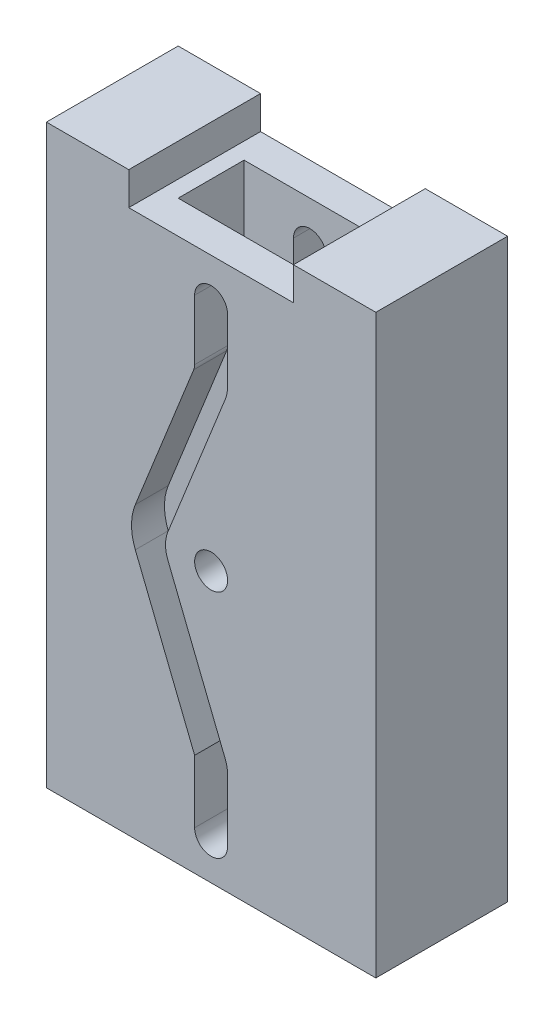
ISO-10303-21;
HEADER;
FILE_DESCRIPTION(('STEP AP214'),'2;1');
FILE_NAME('part.step','',(''),(''),'','','');
FILE_SCHEMA(('AUTOMOTIVE_DESIGN { 1 0 10303 214 1 1 1 1 }'));
ENDSEC;
DATA;
#1=APPLICATION_CONTEXT('core data for automotive mechanical design processes');
#2=APPLICATION_PROTOCOL_DEFINITION('international standard','automotive_design',2000,#1);
#3=PRODUCT_CONTEXT('',#1,'mechanical');
#4=PRODUCT('Part','Part','',(#3));
#5=PRODUCT_RELATED_PRODUCT_CATEGORY('part','',(#4));
#6=PRODUCT_DEFINITION_FORMATION('','',#4);
#7=PRODUCT_DEFINITION_CONTEXT('part definition',#1,'design');
#8=PRODUCT_DEFINITION('design','',#6,#7);
#9=PRODUCT_DEFINITION_SHAPE('','',#8);
#10=(LENGTH_UNIT() NAMED_UNIT(*) SI_UNIT(.MILLI.,.METRE.));
#11=(NAMED_UNIT(*) PLANE_ANGLE_UNIT() SI_UNIT($,.RADIAN.));
#12=(NAMED_UNIT(*) SI_UNIT($,.STERADIAN.) SOLID_ANGLE_UNIT());
#13=UNCERTAINTY_MEASURE_WITH_UNIT(LENGTH_MEASURE(1.E-05),#10,'distance_accuracy_value','');
#14=(GEOMETRIC_REPRESENTATION_CONTEXT(3) GLOBAL_UNCERTAINTY_ASSIGNED_CONTEXT((#13)) GLOBAL_UNIT_ASSIGNED_CONTEXT((#10,
#11,#12)) REPRESENTATION_CONTEXT('',''));
#15=CARTESIAN_POINT('',(0.,0.,0.));
#16=DIRECTION('',(0.,0.,1.));
#17=DIRECTION('',(1.,0.,0.));
#18=AXIS2_PLACEMENT_3D('',#15,#16,#17);
#19=CARTESIAN_POINT('',(50.,175.,40.));
#20=DIRECTION('',(0.,-1.,0.));
#21=DIRECTION('',(0.,0.,-1.));
#22=AXIS2_PLACEMENT_3D('',#19,#20,#21);
#23=PLANE('',#22);
#24=DIRECTION('',(-1.,0.,0.));
#25=VECTOR('',#24,1.);
#26=CARTESIAN_POINT('',(50.,175.,0.));
#27=LINE('',#26,#25);
#28=CARTESIAN_POINT('',(50.,175.,0.));
#29=VERTEX_POINT('',#28);
#30=CARTESIAN_POINT('',(25.,175.,0.));
#31=VERTEX_POINT('',#30);
#32=EDGE_CURVE('E611',#29,#31,#27,.T.);
#33=ORIENTED_EDGE('',*,*,#32,.T.);
#34=DIRECTION('',(0.,0.,-1.));
#35=VECTOR('',#34,1.);
#36=CARTESIAN_POINT('',(25.,175.,0.));
#37=LINE('',#36,#35);
#38=CARTESIAN_POINT('',(25.,175.,40.));
#39=VERTEX_POINT('',#38);
#40=EDGE_CURVE('E576',#39,#31,#37,.T.);
#41=ORIENTED_EDGE('',*,*,#40,.F.);
#42=DIRECTION('',(-1.,0.,0.));
#43=VECTOR('',#42,1.);
#44=CARTESIAN_POINT('',(50.,175.,40.));
#45=LINE('',#44,#43);
#46=CARTESIAN_POINT('',(50.,175.,40.));
#47=VERTEX_POINT('',#46);
#48=EDGE_CURVE('E622',#47,#39,#45,.T.);
#49=ORIENTED_EDGE('',*,*,#48,.F.);
#50=DIRECTION('',(0.,0.,-1.));
#51=VECTOR('',#50,1.);
#52=CARTESIAN_POINT('',(50.,175.,40.));
#53=LINE('',#52,#51);
#54=EDGE_CURVE('E633',#47,#29,#53,.T.);
#55=ORIENTED_EDGE('',*,*,#54,.T.);
#56=EDGE_LOOP('',(#33,#41,#49,#55));
#57=FACE_BOUND('',#56,.T.);
#58=ADVANCED_FACE('F24',(#57),#23,.F.);
#59=CARTESIAN_POINT('',(0.,0.,40.));
#60=DIRECTION('',(0.,1.,0.));
#61=DIRECTION('',(-1.,0.,0.));
#62=AXIS2_PLACEMENT_3D('',#59,#60,#61);
#63=PLANE('',#62);
#64=DIRECTION('',(1.,0.,0.));
#65=VECTOR('',#64,1.);
#66=CARTESIAN_POINT('',(20.,0.,30.));
#67=LINE('',#66,#65);
#68=CARTESIAN_POINT('',(-20.,0.,30.));
#69=VERTEX_POINT('',#68);
#70=CARTESIAN_POINT('',(20.,0.,30.));
#71=VERTEX_POINT('',#70);
#72=EDGE_CURVE('E532',#69,#71,#67,.T.);
#73=ORIENTED_EDGE('',*,*,#72,.T.);
#74=DIRECTION('',(0.,0.,-1.));
#75=VECTOR('',#74,1.);
#76=CARTESIAN_POINT('',(20.,0.,10.));
#77=LINE('',#76,#75);
#78=CARTESIAN_POINT('',(20.,0.,10.));
#79=VERTEX_POINT('',#78);
#80=EDGE_CURVE('E523',#71,#79,#77,.T.);
#81=ORIENTED_EDGE('',*,*,#80,.T.);
#82=DIRECTION('',(-1.,0.,0.));
#83=VECTOR('',#82,1.);
#84=CARTESIAN_POINT('',(20.,0.,10.));
#85=LINE('',#84,#83);
#86=CARTESIAN_POINT('',(-20.,0.,10.));
#87=VERTEX_POINT('',#86);
#88=EDGE_CURVE('E526',#79,#87,#85,.T.);
#89=ORIENTED_EDGE('',*,*,#88,.T.);
#90=DIRECTION('',(0.,0.,1.));
#91=VECTOR('',#90,1.);
#92=CARTESIAN_POINT('',(-20.,0.,10.));
#93=LINE('',#92,#91);
#94=EDGE_CURVE('E529',#87,#69,#93,.T.);
#95=ORIENTED_EDGE('',*,*,#94,.T.);
#96=EDGE_LOOP('',(#73,#81,#89,#95));
#97=FACE_BOUND('',#96,.T.);
#98=DIRECTION('',(1.,0.,0.));
#99=VECTOR('',#98,1.);
#100=CARTESIAN_POINT('',(0.,0.,0.));
#101=LINE('',#100,#99);
#102=CARTESIAN_POINT('',(-50.0000000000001,0.,0.));
#103=VERTEX_POINT('',#102);
#104=CARTESIAN_POINT('',(50.0000000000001,0.,0.));
#105=VERTEX_POINT('',#104);
#106=EDGE_CURVE('E599',#103,#105,#101,.T.);
#107=ORIENTED_EDGE('',*,*,#106,.T.);
#108=DIRECTION('',(0.,0.,-1.));
#109=VECTOR('',#108,1.);
#110=CARTESIAN_POINT('',(50.0000000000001,0.,40.));
#111=LINE('',#110,#109);
#112=CARTESIAN_POINT('',(50.0000000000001,0.,40.));
#113=VERTEX_POINT('',#112);
#114=EDGE_CURVE('E636',#113,#105,#111,.T.);
#115=ORIENTED_EDGE('',*,*,#114,.F.);
#116=DIRECTION('',(1.,0.,0.));
#117=VECTOR('',#116,1.);
#118=CARTESIAN_POINT('',(-50.0000000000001,0.,40.));
#119=LINE('',#118,#117);
#120=CARTESIAN_POINT('',(-50.0000000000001,0.,40.));
#121=VERTEX_POINT('',#120);
#122=EDGE_CURVE('E617',#121,#113,#119,.T.);
#123=ORIENTED_EDGE('',*,*,#122,.F.);
#124=DIRECTION('',(0.,0.,-1.));
#125=VECTOR('',#124,1.);
#126=CARTESIAN_POINT('',(-50.0000000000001,0.,40.));
#127=LINE('',#126,#125);
#128=EDGE_CURVE('E627',#121,#103,#127,.T.);
#129=ORIENTED_EDGE('',*,*,#128,.T.);
#130=EDGE_LOOP('',(#107,#115,#123,#129));
#131=FACE_BOUND('',#130,.T.);
#132=ADVANCED_FACE('F26',(#97,#131),#63,.F.);
#133=CARTESIAN_POINT('',(50.0000000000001,0.,40.));
#134=DIRECTION('',(-1.,0.,0.));
#135=DIRECTION('',(0.,-1.,0.));
#136=AXIS2_PLACEMENT_3D('',#133,#134,#135);
#137=PLANE('',#136);
#138=DIRECTION('',(0.,1.,0.));
#139=VECTOR('',#138,1.);
#140=CARTESIAN_POINT('',(50.0000000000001,0.,0.));
#141=LINE('',#140,#139);
#142=EDGE_CURVE('E608',#105,#29,#141,.T.);
#143=ORIENTED_EDGE('',*,*,#142,.T.);
#144=ORIENTED_EDGE('',*,*,#54,.F.);
#145=DIRECTION('',(0.,1.,0.));
#146=VECTOR('',#145,1.);
#147=CARTESIAN_POINT('',(50.0000000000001,0.,40.));
#148=LINE('',#147,#146);
#149=EDGE_CURVE('E619',#113,#47,#148,.T.);
#150=ORIENTED_EDGE('',*,*,#149,.F.);
#151=ORIENTED_EDGE('',*,*,#114,.T.);
#152=EDGE_LOOP('',(#143,#144,#150,#151));
#153=FACE_BOUND('',#152,.T.);
#154=ADVANCED_FACE('F726',(#153),#137,.F.);
#155=CARTESIAN_POINT('',(-25.,175.,40.));
#156=VERTEX_POINT('',#155);
#157=CARTESIAN_POINT('',(-50.,175.,40.));
#158=VERTEX_POINT('',#157);
#159=EDGE_CURVE('E621',#156,#158,#45,.T.);
#160=ORIENTED_EDGE('',*,*,#159,.F.);
#161=DIRECTION('',(0.,0.,1.));
#162=VECTOR('',#161,1.);
#163=CARTESIAN_POINT('',(-25.,175.,0.));
#164=LINE('',#163,#162);
#165=CARTESIAN_POINT('',(-25.,175.,0.));
#166=VERTEX_POINT('',#165);
#167=EDGE_CURVE('E583',#166,#156,#164,.T.);
#168=ORIENTED_EDGE('',*,*,#167,.F.);
#169=CARTESIAN_POINT('',(-50.,175.,0.));
#170=VERTEX_POINT('',#169);
#171=EDGE_CURVE('E610',#166,#170,#27,.T.);
#172=ORIENTED_EDGE('',*,*,#171,.T.);
#173=DIRECTION('',(0.,0.,-1.));
#174=VECTOR('',#173,1.);
#175=CARTESIAN_POINT('',(-50.,175.,40.));
#176=LINE('',#175,#174);
#177=EDGE_CURVE('E630',#158,#170,#176,.T.);
#178=ORIENTED_EDGE('',*,*,#177,.F.);
#179=EDGE_LOOP('',(#160,#168,#172,#178));
#180=FACE_BOUND('',#179,.T.);
#181=ADVANCED_FACE('F717',(#180),#23,.F.);
#182=CARTESIAN_POINT('',(-50.,175.,40.));
#183=DIRECTION('',(1.,0.,0.));
#184=DIRECTION('',(0.,1.,0.));
#185=AXIS2_PLACEMENT_3D('',#182,#183,#184);
#186=PLANE('',#185);
#187=DIRECTION('',(0.,0.,1.));
#188=VECTOR('',#187,1.);
#189=CARTESIAN_POINT('',(-50.0000000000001,10.,9.99999999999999));
#190=LINE('',#189,#188);
#191=CARTESIAN_POINT('',(-50.0000000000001,10.,9.99999999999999));
#192=VERTEX_POINT('',#191);
#193=CARTESIAN_POINT('',(-50.0000000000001,10.,30.));
#194=VERTEX_POINT('',#193);
#195=EDGE_CURVE('E560',#192,#194,#190,.T.);
#196=ORIENTED_EDGE('',*,*,#195,.F.);
#197=DIRECTION('',(0.,-1.,0.));
#198=VECTOR('',#197,1.);
#199=CARTESIAN_POINT('',(-50.,130.,10.));
#200=LINE('',#199,#198);
#201=CARTESIAN_POINT('',(-50.,130.,10.));
#202=VERTEX_POINT('',#201);
#203=EDGE_CURVE('E557',#202,#192,#200,.T.);
#204=ORIENTED_EDGE('',*,*,#203,.F.);
#205=DIRECTION('',(0.,0.,-1.));
#206=VECTOR('',#205,1.);
#207=CARTESIAN_POINT('',(-50.,130.,10.));
#208=LINE('',#207,#206);
#209=CARTESIAN_POINT('',(-50.,130.,30.));
#210=VERTEX_POINT('',#209);
#211=EDGE_CURVE('E566',#210,#202,#208,.T.);
#212=ORIENTED_EDGE('',*,*,#211,.F.);
#213=DIRECTION('',(0.,1.,0.));
#214=VECTOR('',#213,1.);
#215=CARTESIAN_POINT('',(-50.,130.,30.));
#216=LINE('',#215,#214);
#217=EDGE_CURVE('E563',#194,#210,#216,.T.);
#218=ORIENTED_EDGE('',*,*,#217,.F.);
#219=EDGE_LOOP('',(#196,#204,#212,#218));
#220=FACE_BOUND('',#219,.T.);
#221=DIRECTION('',(0.,-1.,0.));
#222=VECTOR('',#221,1.);
#223=CARTESIAN_POINT('',(-50.,175.,0.));
#224=LINE('',#223,#222);
#225=EDGE_CURVE('E614',#170,#103,#224,.T.);
#226=ORIENTED_EDGE('',*,*,#225,.T.);
#227=ORIENTED_EDGE('',*,*,#128,.F.);
#228=DIRECTION('',(0.,-1.,0.));
#229=VECTOR('',#228,1.);
#230=CARTESIAN_POINT('',(-50.,175.,40.));
#231=LINE('',#230,#229);
#232=EDGE_CURVE('E625',#158,#121,#231,.T.);
#233=ORIENTED_EDGE('',*,*,#232,.F.);
#234=ORIENTED_EDGE('',*,*,#177,.T.);
#235=EDGE_LOOP('',(#226,#227,#233,#234));
#236=FACE_BOUND('',#235,.T.);
#237=ADVANCED_FACE('F708',(#220,#236),#186,.F.);
#238=CARTESIAN_POINT('',(-50.0000000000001,0.,40.));
#239=DIRECTION('',(0.,0.,-1.));
#240=DIRECTION('',(-1.,0.,0.));
#241=AXIS2_PLACEMENT_3D('',#238,#239,#240);
#242=PLANE('',#241);
#243=CARTESIAN_POINT('',(0.,82.,40.));
#244=DIRECTION('',(0.,0.,1.));
#245=DIRECTION('',(1.,0.,0.));
#246=AXIS2_PLACEMENT_3D('',#243,#244,#245);
#247=CIRCLE('',#246,5.00000000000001);
#248=CARTESIAN_POINT('',(5.,82.,40.));
#249=VERTEX_POINT('',#248);
#250=EDGE_CURVE('E699',#249,#249,#247,.T.);
#251=ORIENTED_EDGE('',*,*,#250,.F.);
#252=EDGE_LOOP('',(#251));
#253=FACE_BOUND('',#252,.T.);
#254=DIRECTION('',(0.,-1.,0.));
#255=VECTOR('',#254,1.);
#256=CARTESIAN_POINT('',(-5.,152.,40.));
#257=LINE('',#256,#255);
#258=CARTESIAN_POINT('',(-5.,152.,40.));
#259=VERTEX_POINT('',#258);
#260=CARTESIAN_POINT('',(-5.,133.733241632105,40.));
#261=VERTEX_POINT('',#260);
#262=EDGE_CURVE('E335',#259,#261,#257,.T.);
#263=ORIENTED_EDGE('',*,*,#262,.F.);
#264=CARTESIAN_POINT('',(0.,152.,40.));
#265=DIRECTION('',(0.,0.,1.));
#266=DIRECTION('',(-1.,0.,0.));
#267=AXIS2_PLACEMENT_3D('',#264,#265,#266);
#268=CIRCLE('',#267,5.);
#269=CARTESIAN_POINT('',(5.,152.,40.));
#270=VERTEX_POINT('',#269);
#271=EDGE_CURVE('E40',#270,#259,#268,.T.);
#272=ORIENTED_EDGE('',*,*,#271,.F.);
#273=DIRECTION('',(0.,1.,0.));
#274=VECTOR('',#273,1.);
#275=CARTESIAN_POINT('',(5.,152.,40.));
#276=LINE('',#275,#274);
#277=CARTESIAN_POINT('',(5.,132.962912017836,40.));
#278=VERTEX_POINT('',#277);
#279=EDGE_CURVE('E379',#278,#270,#276,.T.);
#280=ORIENTED_EDGE('',*,*,#279,.F.);
#281=CARTESIAN_POINT('',(-5.,132.962912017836,40.));
#282=DIRECTION('',(0.,0.,1.));
#283=DIRECTION('',(-1.,0.,0.));
#284=AXIS2_PLACEMENT_3D('',#281,#282,#283);
#285=CIRCLE('',#284,9.99999999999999);
#286=CARTESIAN_POINT('',(4.28476690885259,129.249005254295,40.));
#287=VERTEX_POINT('',#286);
#288=EDGE_CURVE('E376',#287,#278,#285,.T.);
#289=ORIENTED_EDGE('',*,*,#288,.F.);
#290=DIRECTION('',(0.371390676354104,0.928476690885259,0.));
#291=VECTOR('',#290,1.);
#292=CARTESIAN_POINT('',(4.28476690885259,129.249005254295,40.));
#293=LINE('',#292,#291);
#294=CARTESIAN_POINT('',(-13.1292724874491,85.7139067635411,40.));
#295=VERTEX_POINT('',#294);
#296=EDGE_CURVE('E373',#295,#287,#293,.T.);
#297=ORIENTED_EDGE('',*,*,#296,.F.);
#298=CARTESIAN_POINT('',(-3.84450557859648,82.,40.));
#299=DIRECTION('',(0.,0.,-1.));
#300=DIRECTION('',(1.,0.,0.));
#301=AXIS2_PLACEMENT_3D('',#298,#299,#300);
#302=CIRCLE('',#301,10.);
#303=CARTESIAN_POINT('',(-13.1292724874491,78.286093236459,40.));
#304=VERTEX_POINT('',#303);
#305=EDGE_CURVE('E370',#304,#295,#302,.T.);
#306=ORIENTED_EDGE('',*,*,#305,.F.);
#307=DIRECTION('',(-0.371390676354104,0.928476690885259,0.));
#308=VECTOR('',#307,1.);
#309=CARTESIAN_POINT('',(-13.1292724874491,78.286093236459,40.));
#310=LINE('',#309,#308);
#311=CARTESIAN_POINT('',(4.28476690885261,34.7509947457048,40.));
#312=VERTEX_POINT('',#311);
#313=EDGE_CURVE('E367',#312,#304,#310,.T.);
#314=ORIENTED_EDGE('',*,*,#313,.F.);
#315=CARTESIAN_POINT('',(-4.99999999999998,31.0370879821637,40.));
#316=DIRECTION('',(0.,0.,1.));
#317=DIRECTION('',(1.,0.,0.));
#318=AXIS2_PLACEMENT_3D('',#315,#316,#317);
#319=CIRCLE('',#318,10.);
#320=CARTESIAN_POINT('',(5.00000000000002,31.0370879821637,40.));
#321=VERTEX_POINT('',#320);
#322=EDGE_CURVE('E364',#321,#312,#319,.T.);
#323=ORIENTED_EDGE('',*,*,#322,.F.);
#324=DIRECTION('',(0.,1.,0.));
#325=VECTOR('',#324,1.);
#326=CARTESIAN_POINT('',(5.00000000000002,31.0370879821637,40.));
#327=LINE('',#326,#325);
#328=CARTESIAN_POINT('',(5.00000000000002,12.,40.));
#329=VERTEX_POINT('',#328);
#330=EDGE_CURVE('E361',#329,#321,#327,.T.);
#331=ORIENTED_EDGE('',*,*,#330,.F.);
#332=CARTESIAN_POINT('',(0.,12.,40.));
#333=DIRECTION('',(0.,0.,1.));
#334=DIRECTION('',(1.,0.,0.));
#335=AXIS2_PLACEMENT_3D('',#332,#333,#334);
#336=CIRCLE('',#335,5.);
#337=CARTESIAN_POINT('',(-4.99999999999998,12.,40.));
#338=VERTEX_POINT('',#337);
#339=EDGE_CURVE('E358',#338,#329,#336,.T.);
#340=ORIENTED_EDGE('',*,*,#339,.F.);
#341=DIRECTION('',(0.,-1.,0.));
#342=VECTOR('',#341,1.);
#343=CARTESIAN_POINT('',(-4.99999999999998,31.0370879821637,40.));
#344=LINE('',#343,#342);
#345=CARTESIAN_POINT('',(-4.99999999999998,31.0370879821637,40.));
#346=VERTEX_POINT('',#345);
#347=EDGE_CURVE('E355',#346,#338,#344,.T.);
#348=ORIENTED_EDGE('',*,*,#347,.F.);
#349=DIRECTION('',(0.371390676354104,-0.928476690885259,0.));
#350=VECTOR('',#349,1.);
#351=CARTESIAN_POINT('',(-23.0082644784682,76.0577491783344,40.));
#352=LINE('',#351,#350);
#353=CARTESIAN_POINT('',(-23.0082644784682,76.0577491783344,40.));
#354=VERTEX_POINT('',#353);
#355=EDGE_CURVE('E352',#354,#346,#352,.T.);
#356=ORIENTED_EDGE('',*,*,#355,.F.);
#357=CARTESIAN_POINT('',(-8.15263742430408,82.,40.));
#358=DIRECTION('',(0.,0.,1.));
#359=DIRECTION('',(1.,0.,0.));
#360=AXIS2_PLACEMENT_3D('',#357,#358,#359);
#361=CIRCLE('',#360,16.);
#362=CARTESIAN_POINT('',(-23.0082644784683,87.9422508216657,40.));
#363=VERTEX_POINT('',#362);
#364=EDGE_CURVE('E346',#363,#354,#361,.T.);
#365=ORIENTED_EDGE('',*,*,#364,.F.);
#366=DIRECTION('',(-0.371390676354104,-0.928476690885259,0.));
#367=VECTOR('',#366,1.);
#368=CARTESIAN_POINT('',(-5.28609323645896,132.247678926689,40.));
#369=LINE('',#368,#367);
#370=CARTESIAN_POINT('',(-5.28609323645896,132.247678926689,40.));
#371=VERTEX_POINT('',#370);
#372=EDGE_CURVE('E344',#371,#363,#369,.T.);
#373=ORIENTED_EDGE('',*,*,#372,.F.);
#374=CARTESIAN_POINT('',(-9.,133.733241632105,40.));
#375=DIRECTION('',(0.,0.,-1.));
#376=DIRECTION('',(-1.,0.,0.));
#377=AXIS2_PLACEMENT_3D('',#374,#375,#376);
#378=CIRCLE('',#377,4.);
#379=EDGE_CURVE('E325',#261,#371,#378,.T.);
#380=ORIENTED_EDGE('',*,*,#379,.F.);
#381=EDGE_LOOP('',(#263,#272,#280,#289,#297,#306,#314,#323,#331,#340,#348,#356,#365,#373,#380));
#382=FACE_BOUND('',#381,.T.);
#383=ORIENTED_EDGE('',*,*,#48,.T.);
#384=DIRECTION('',(0.,1.,0.));
#385=VECTOR('',#384,1.);
#386=CARTESIAN_POINT('',(25.,165.,40.));
#387=LINE('',#386,#385);
#388=CARTESIAN_POINT('',(25.,165.,40.));
#389=VERTEX_POINT('',#388);
#390=EDGE_CURVE('E597',#389,#39,#387,.T.);
#391=ORIENTED_EDGE('',*,*,#390,.F.);
#392=DIRECTION('',(1.,0.,0.));
#393=VECTOR('',#392,1.);
#394=CARTESIAN_POINT('',(25.,165.,40.));
#395=LINE('',#394,#393);
#396=CARTESIAN_POINT('',(-25.,165.,40.));
#397=VERTEX_POINT('',#396);
#398=EDGE_CURVE('E593',#397,#389,#395,.T.);
#399=ORIENTED_EDGE('',*,*,#398,.F.);
#400=DIRECTION('',(0.,1.,0.));
#401=VECTOR('',#400,1.);
#402=CARTESIAN_POINT('',(-25.,165.,40.));
#403=LINE('',#402,#401);
#404=EDGE_CURVE('E600',#397,#156,#403,.T.);
#405=ORIENTED_EDGE('',*,*,#404,.T.);
#406=ORIENTED_EDGE('',*,*,#159,.T.);
#407=ORIENTED_EDGE('',*,*,#232,.T.);
#408=ORIENTED_EDGE('',*,*,#122,.T.);
#409=ORIENTED_EDGE('',*,*,#149,.T.);
#410=EDGE_LOOP('',(#383,#391,#399,#405,#406,#407,#408,#409));
#411=FACE_BOUND('',#410,.T.);
#412=ADVANCED_FACE('F340',(#253,#382,#411),#242,.F.);
#413=CARTESIAN_POINT('',(-50.0000000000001,0.,0.));
#414=DIRECTION('',(0.,0.,-1.));
#415=DIRECTION('',(-1.,0.,0.));
#416=AXIS2_PLACEMENT_3D('',#413,#414,#415);
#417=PLANE('',#416);
#418=CARTESIAN_POINT('',(0.,82.,0.));
#419=DIRECTION('',(0.,0.,1.));
#420=DIRECTION('',(1.,0.,0.));
#421=AXIS2_PLACEMENT_3D('',#418,#419,#420);
#422=CIRCLE('',#421,5.00000000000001);
#423=CARTESIAN_POINT('',(5.,82.,0.));
#424=VERTEX_POINT('',#423);
#425=EDGE_CURVE('E696',#424,#424,#422,.T.);
#426=ORIENTED_EDGE('',*,*,#425,.T.);
#427=EDGE_LOOP('',(#426));
#428=FACE_BOUND('',#427,.T.);
#429=CARTESIAN_POINT('',(0.,152.,0.));
#430=DIRECTION('',(0.,0.,1.));
#431=DIRECTION('',(-1.,0.,0.));
#432=AXIS2_PLACEMENT_3D('',#429,#430,#431);
#433=CIRCLE('',#432,5.);
#434=CARTESIAN_POINT('',(5.,152.,0.));
#435=VERTEX_POINT('',#434);
#436=CARTESIAN_POINT('',(-5.,152.,0.));
#437=VERTEX_POINT('',#436);
#438=EDGE_CURVE('E382',#435,#437,#433,.T.);
#439=ORIENTED_EDGE('',*,*,#438,.T.);
#440=DIRECTION('',(0.,-1.,0.));
#441=VECTOR('',#440,1.);
#442=CARTESIAN_POINT('',(-5.,152.,0.));
#443=LINE('',#442,#441);
#444=CARTESIAN_POINT('',(-4.99999999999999,133.733241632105,0.));
#445=VERTEX_POINT('',#444);
#446=EDGE_CURVE('E385',#437,#445,#443,.T.);
#447=ORIENTED_EDGE('',*,*,#446,.T.);
#448=CARTESIAN_POINT('',(-9.,133.733241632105,0.));
#449=DIRECTION('',(0.,0.,-1.));
#450=DIRECTION('',(-1.,0.,0.));
#451=AXIS2_PLACEMENT_3D('',#448,#449,#450);
#452=CIRCLE('',#451,4.);
#453=CARTESIAN_POINT('',(-5.28609323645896,132.247678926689,0.));
#454=VERTEX_POINT('',#453);
#455=EDGE_CURVE('E48',#445,#454,#452,.T.);
#456=ORIENTED_EDGE('',*,*,#455,.T.);
#457=DIRECTION('',(-0.371390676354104,-0.928476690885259,0.));
#458=VECTOR('',#457,1.);
#459=CARTESIAN_POINT('',(-5.28609323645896,132.247678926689,0.));
#460=LINE('',#459,#458);
#461=CARTESIAN_POINT('',(-23.0082644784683,87.9422508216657,0.));
#462=VERTEX_POINT('',#461);
#463=EDGE_CURVE('E389',#454,#462,#460,.T.);
#464=ORIENTED_EDGE('',*,*,#463,.T.);
#465=CARTESIAN_POINT('',(-8.15263742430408,82.,0.));
#466=DIRECTION('',(0.,0.,1.));
#467=DIRECTION('',(1.,0.,0.));
#468=AXIS2_PLACEMENT_3D('',#465,#466,#467);
#469=CIRCLE('',#468,16.);
#470=CARTESIAN_POINT('',(-23.0082644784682,76.0577491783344,0.));
#471=VERTEX_POINT('',#470);
#472=EDGE_CURVE('E392',#462,#471,#469,.T.);
#473=ORIENTED_EDGE('',*,*,#472,.T.);
#474=DIRECTION('',(0.371390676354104,-0.928476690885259,0.));
#475=VECTOR('',#474,1.);
#476=CARTESIAN_POINT('',(-23.0082644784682,76.0577491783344,0.));
#477=LINE('',#476,#475);
#478=CARTESIAN_POINT('',(-4.99999999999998,31.0370879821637,0.));
#479=VERTEX_POINT('',#478);
#480=EDGE_CURVE('E395',#471,#479,#477,.T.);
#481=ORIENTED_EDGE('',*,*,#480,.T.);
#482=DIRECTION('',(0.,-1.,0.));
#483=VECTOR('',#482,1.);
#484=CARTESIAN_POINT('',(-4.99999999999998,31.0370879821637,0.));
#485=LINE('',#484,#483);
#486=CARTESIAN_POINT('',(-4.99999999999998,12.,0.));
#487=VERTEX_POINT('',#486);
#488=EDGE_CURVE('E398',#479,#487,#485,.T.);
#489=ORIENTED_EDGE('',*,*,#488,.T.);
#490=CARTESIAN_POINT('',(0.,12.,0.));
#491=DIRECTION('',(0.,0.,1.));
#492=DIRECTION('',(1.,0.,0.));
#493=AXIS2_PLACEMENT_3D('',#490,#491,#492);
#494=CIRCLE('',#493,5.);
#495=CARTESIAN_POINT('',(5.00000000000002,12.,0.));
#496=VERTEX_POINT('',#495);
#497=EDGE_CURVE('E401',#487,#496,#494,.T.);
#498=ORIENTED_EDGE('',*,*,#497,.T.);
#499=DIRECTION('',(0.,1.,0.));
#500=VECTOR('',#499,1.);
#501=CARTESIAN_POINT('',(5.00000000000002,31.0370879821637,0.));
#502=LINE('',#501,#500);
#503=CARTESIAN_POINT('',(5.00000000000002,31.0370879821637,0.));
#504=VERTEX_POINT('',#503);
#505=EDGE_CURVE('E404',#496,#504,#502,.T.);
#506=ORIENTED_EDGE('',*,*,#505,.T.);
#507=CARTESIAN_POINT('',(-4.99999999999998,31.0370879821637,0.));
#508=DIRECTION('',(0.,0.,1.));
#509=DIRECTION('',(1.,0.,0.));
#510=AXIS2_PLACEMENT_3D('',#507,#508,#509);
#511=CIRCLE('',#510,10.);
#512=CARTESIAN_POINT('',(4.28476690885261,34.7509947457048,0.));
#513=VERTEX_POINT('',#512);
#514=EDGE_CURVE('E407',#504,#513,#511,.T.);
#515=ORIENTED_EDGE('',*,*,#514,.T.);
#516=DIRECTION('',(-0.371390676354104,0.928476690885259,0.));
#517=VECTOR('',#516,1.);
#518=CARTESIAN_POINT('',(-13.1292724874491,78.286093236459,0.));
#519=LINE('',#518,#517);
#520=CARTESIAN_POINT('',(-13.1292724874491,78.286093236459,0.));
#521=VERTEX_POINT('',#520);
#522=EDGE_CURVE('E410',#513,#521,#519,.T.);
#523=ORIENTED_EDGE('',*,*,#522,.T.);
#524=CARTESIAN_POINT('',(-3.84450557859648,82.,0.));
#525=DIRECTION('',(0.,0.,-1.));
#526=DIRECTION('',(1.,0.,0.));
#527=AXIS2_PLACEMENT_3D('',#524,#525,#526);
#528=CIRCLE('',#527,10.);
#529=CARTESIAN_POINT('',(-13.1292724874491,85.7139067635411,0.));
#530=VERTEX_POINT('',#529);
#531=EDGE_CURVE('E413',#521,#530,#528,.T.);
#532=ORIENTED_EDGE('',*,*,#531,.T.);
#533=DIRECTION('',(0.371390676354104,0.928476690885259,0.));
#534=VECTOR('',#533,1.);
#535=CARTESIAN_POINT('',(4.28476690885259,129.249005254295,0.));
#536=LINE('',#535,#534);
#537=CARTESIAN_POINT('',(4.28476690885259,129.249005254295,0.));
#538=VERTEX_POINT('',#537);
#539=EDGE_CURVE('E416',#530,#538,#536,.T.);
#540=ORIENTED_EDGE('',*,*,#539,.T.);
#541=CARTESIAN_POINT('',(-5.,132.962912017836,0.));
#542=DIRECTION('',(0.,0.,1.));
#543=DIRECTION('',(-1.,0.,0.));
#544=AXIS2_PLACEMENT_3D('',#541,#542,#543);
#545=CIRCLE('',#544,9.99999999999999);
#546=CARTESIAN_POINT('',(5.,132.962912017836,0.));
#547=VERTEX_POINT('',#546);
#548=EDGE_CURVE('E419',#538,#547,#545,.T.);
#549=ORIENTED_EDGE('',*,*,#548,.T.);
#550=DIRECTION('',(0.,1.,0.));
#551=VECTOR('',#550,1.);
#552=CARTESIAN_POINT('',(5.,152.,0.));
#553=LINE('',#552,#551);
#554=EDGE_CURVE('E422',#547,#435,#553,.T.);
#555=ORIENTED_EDGE('',*,*,#554,.T.);
#556=EDGE_LOOP('',(#439,#447,#456,#464,#473,#481,#489,#498,#506,#515,#523,#532,#540,#549,#555));
#557=FACE_BOUND('',#556,.T.);
#558=DIRECTION('',(0.,1.,0.));
#559=VECTOR('',#558,1.);
#560=CARTESIAN_POINT('',(25.,165.,0.));
#561=LINE('',#560,#559);
#562=CARTESIAN_POINT('',(25.,165.,0.));
#563=VERTEX_POINT('',#562);
#564=EDGE_CURVE('E596',#563,#31,#561,.T.);
#565=ORIENTED_EDGE('',*,*,#564,.T.);
#566=ORIENTED_EDGE('',*,*,#32,.F.);
#567=ORIENTED_EDGE('',*,*,#142,.F.);
#568=ORIENTED_EDGE('',*,*,#106,.F.);
#569=ORIENTED_EDGE('',*,*,#225,.F.);
#570=ORIENTED_EDGE('',*,*,#171,.F.);
#571=DIRECTION('',(0.,1.,0.));
#572=VECTOR('',#571,1.);
#573=CARTESIAN_POINT('',(-25.,165.,0.));
#574=LINE('',#573,#572);
#575=CARTESIAN_POINT('',(-25.,165.,0.));
#576=VERTEX_POINT('',#575);
#577=EDGE_CURVE('E603',#576,#166,#574,.T.);
#578=ORIENTED_EDGE('',*,*,#577,.F.);
#579=DIRECTION('',(-1.,0.,0.));
#580=VECTOR('',#579,1.);
#581=CARTESIAN_POINT('',(25.,165.,0.));
#582=LINE('',#581,#580);
#583=EDGE_CURVE('E587',#563,#576,#582,.T.);
#584=ORIENTED_EDGE('',*,*,#583,.F.);
#585=EDGE_LOOP('',(#565,#566,#567,#568,#569,#570,#578,#584));
#586=FACE_BOUND('',#585,.T.);
#587=ADVANCED_FACE('F707',(#428,#557,#586),#417,.T.);
#588=CARTESIAN_POINT('',(25.,165.,0.));
#589=DIRECTION('',(1.,0.,0.));
#590=DIRECTION('',(0.,0.,-1.));
#591=AXIS2_PLACEMENT_3D('',#588,#589,#590);
#592=PLANE('',#591);
#593=ORIENTED_EDGE('',*,*,#40,.T.);
#594=ORIENTED_EDGE('',*,*,#564,.F.);
#595=DIRECTION('',(0.,0.,-1.));
#596=VECTOR('',#595,1.);
#597=CARTESIAN_POINT('',(25.,165.,0.));
#598=LINE('',#597,#596);
#599=EDGE_CURVE('E585',#389,#563,#598,.T.);
#600=ORIENTED_EDGE('',*,*,#599,.F.);
#601=ORIENTED_EDGE('',*,*,#390,.T.);
#602=EDGE_LOOP('',(#593,#594,#600,#601));
#603=FACE_BOUND('',#602,.T.);
#604=ADVANCED_FACE('F714',(#603),#592,.F.);
#605=CARTESIAN_POINT('',(-25.,165.,0.));
#606=DIRECTION('',(-1.,0.,0.));
#607=DIRECTION('',(0.,0.,1.));
#608=AXIS2_PLACEMENT_3D('',#605,#606,#607);
#609=PLANE('',#608);
#610=ORIENTED_EDGE('',*,*,#167,.T.);
#611=ORIENTED_EDGE('',*,*,#404,.F.);
#612=DIRECTION('',(0.,0.,1.));
#613=VECTOR('',#612,1.);
#614=CARTESIAN_POINT('',(-25.,165.,0.));
#615=LINE('',#614,#613);
#616=EDGE_CURVE('E590',#576,#397,#615,.T.);
#617=ORIENTED_EDGE('',*,*,#616,.F.);
#618=ORIENTED_EDGE('',*,*,#577,.T.);
#619=EDGE_LOOP('',(#610,#611,#617,#618));
#620=FACE_BOUND('',#619,.T.);
#621=ADVANCED_FACE('F743',(#620),#609,.F.);
#622=CARTESIAN_POINT('',(25.,165.,40.));
#623=DIRECTION('',(0.,-1.,0.));
#624=DIRECTION('',(0.,0.,-1.));
#625=AXIS2_PLACEMENT_3D('',#622,#623,#624);
#626=PLANE('',#625);
#627=DIRECTION('',(1.,0.,0.));
#628=VECTOR('',#627,1.);
#629=CARTESIAN_POINT('',(25.,165.,10.));
#630=LINE('',#629,#628);
#631=CARTESIAN_POINT('',(-20.,165.,10.));
#632=VERTEX_POINT('',#631);
#633=CARTESIAN_POINT('',(20.,165.,10.));
#634=VERTEX_POINT('',#633);
#635=EDGE_CURVE('E539',#632,#634,#630,.T.);
#636=ORIENTED_EDGE('',*,*,#635,.T.);
#637=DIRECTION('',(0.,0.,1.));
#638=VECTOR('',#637,1.);
#639=CARTESIAN_POINT('',(20.,165.,40.));
#640=LINE('',#639,#638);
#641=CARTESIAN_POINT('',(20.,165.,30.));
#642=VERTEX_POINT('',#641);
#643=EDGE_CURVE('E554',#634,#642,#640,.T.);
#644=ORIENTED_EDGE('',*,*,#643,.T.);
#645=DIRECTION('',(-1.,0.,0.));
#646=VECTOR('',#645,1.);
#647=CARTESIAN_POINT('',(25.,165.,30.));
#648=LINE('',#647,#646);
#649=CARTESIAN_POINT('',(-20.,165.,30.));
#650=VERTEX_POINT('',#649);
#651=EDGE_CURVE('E545',#642,#650,#648,.T.);
#652=ORIENTED_EDGE('',*,*,#651,.T.);
#653=DIRECTION('',(0.,0.,-1.));
#654=VECTOR('',#653,1.);
#655=CARTESIAN_POINT('',(-20.,165.,40.));
#656=LINE('',#655,#654);
#657=EDGE_CURVE('E551',#650,#632,#656,.T.);
#658=ORIENTED_EDGE('',*,*,#657,.T.);
#659=EDGE_LOOP('',(#636,#644,#652,#658));
#660=FACE_BOUND('',#659,.T.);
#661=ORIENTED_EDGE('',*,*,#599,.T.);
#662=ORIENTED_EDGE('',*,*,#583,.T.);
#663=ORIENTED_EDGE('',*,*,#616,.T.);
#664=ORIENTED_EDGE('',*,*,#398,.T.);
#665=EDGE_LOOP('',(#661,#662,#663,#664));
#666=FACE_BOUND('',#665,.T.);
#667=ADVANCED_FACE('F745',(#660,#666),#626,.F.);
#668=CARTESIAN_POINT('',(20.,130.,10.));
#669=DIRECTION('',(0.,0.,-1.));
#670=DIRECTION('',(0.,1.,0.));
#671=AXIS2_PLACEMENT_3D('',#668,#669,#670);
#672=PLANE('',#671);
#673=CARTESIAN_POINT('',(0.,82.,10.));
#674=DIRECTION('',(0.,0.,-1.));
#675=DIRECTION('',(0.,1.,0.));
#676=AXIS2_PLACEMENT_3D('',#673,#674,#675);
#677=CIRCLE('',#676,5.00000000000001);
#678=CARTESIAN_POINT('',(0.,87.,10.));
#679=VERTEX_POINT('',#678);
#680=EDGE_CURVE('E692',#679,#679,#677,.T.);
#681=ORIENTED_EDGE('',*,*,#680,.T.);
#682=EDGE_LOOP('',(#681));
#683=FACE_BOUND('',#682,.T.);
#684=DIRECTION('',(0.,1.,0.));
#685=VECTOR('',#684,1.);
#686=CARTESIAN_POINT('',(-4.99999999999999,130.,10.));
#687=LINE('',#686,#685);
#688=CARTESIAN_POINT('',(-5.,133.733241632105,10.));
#689=VERTEX_POINT('',#688);
#690=CARTESIAN_POINT('',(-5.,152.,10.));
#691=VERTEX_POINT('',#690);
#692=EDGE_CURVE('E428',#689,#691,#687,.T.);
#693=ORIENTED_EDGE('',*,*,#692,.T.);
#694=CARTESIAN_POINT('',(0.,152.,10.));
#695=DIRECTION('',(0.,0.,-1.));
#696=DIRECTION('',(0.,1.,0.));
#697=AXIS2_PLACEMENT_3D('',#694,#695,#696);
#698=CIRCLE('',#697,5.);
#699=CARTESIAN_POINT('',(5.,152.,10.));
#700=VERTEX_POINT('',#699);
#701=EDGE_CURVE('E520',#691,#700,#698,.T.);
#702=ORIENTED_EDGE('',*,*,#701,.T.);
#703=DIRECTION('',(0.,-1.,0.));
#704=VECTOR('',#703,1.);
#705=CARTESIAN_POINT('',(5.,130.,10.));
#706=LINE('',#705,#704);
#707=CARTESIAN_POINT('',(5.,132.962912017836,10.));
#708=VERTEX_POINT('',#707);
#709=EDGE_CURVE('E517',#700,#708,#706,.T.);
#710=ORIENTED_EDGE('',*,*,#709,.T.);
#711=CARTESIAN_POINT('',(-5.,132.962912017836,10.));
#712=DIRECTION('',(0.,0.,-1.));
#713=DIRECTION('',(0.,1.,0.));
#714=AXIS2_PLACEMENT_3D('',#711,#712,#713);
#715=CIRCLE('',#714,9.99999999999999);
#716=CARTESIAN_POINT('',(4.28476690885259,129.249005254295,10.));
#717=VERTEX_POINT('',#716);
#718=EDGE_CURVE('E514',#708,#717,#715,.T.);
#719=ORIENTED_EDGE('',*,*,#718,.T.);
#720=DIRECTION('',(-0.371390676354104,-0.928476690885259,0.));
#721=VECTOR('',#720,1.);
#722=CARTESIAN_POINT('',(6.71134897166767,135.315460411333,10.));
#723=LINE('',#722,#721);
#724=CARTESIAN_POINT('',(-13.1292724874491,85.7139067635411,10.));
#725=VERTEX_POINT('',#724);
#726=EDGE_CURVE('E511',#717,#725,#723,.T.);
#727=ORIENTED_EDGE('',*,*,#726,.T.);
#728=CARTESIAN_POINT('',(-3.84450557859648,82.,10.));
#729=DIRECTION('',(0.,0.,-1.));
#730=DIRECTION('',(0.,1.,0.));
#731=AXIS2_PLACEMENT_3D('',#728,#729,#730);
#732=CIRCLE('',#731,10.);
#733=CARTESIAN_POINT('',(-13.1292724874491,78.286093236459,9.99999999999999));
#734=VERTEX_POINT('',#733);
#735=EDGE_CURVE('E508',#725,#734,#732,.F.);
#736=ORIENTED_EDGE('',*,*,#735,.T.);
#737=DIRECTION('',(0.371390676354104,-0.928476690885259,0.));
#738=VECTOR('',#737,1.);
#739=CARTESIAN_POINT('',(-26.3920993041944,111.443160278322,10.));
#740=LINE('',#739,#738);
#741=CARTESIAN_POINT('',(4.28476690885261,34.7509947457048,9.99999999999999));
#742=VERTEX_POINT('',#741);
#743=EDGE_CURVE('E505',#734,#742,#740,.T.);
#744=ORIENTED_EDGE('',*,*,#743,.T.);
#745=CARTESIAN_POINT('',(-4.99999999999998,31.0370879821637,9.99999999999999));
#746=DIRECTION('',(0.,0.,-1.));
#747=DIRECTION('',(0.,1.,0.));
#748=AXIS2_PLACEMENT_3D('',#745,#746,#747);
#749=CIRCLE('',#748,10.);
#750=CARTESIAN_POINT('',(5.00000000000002,31.0370879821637,9.99999999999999));
#751=VERTEX_POINT('',#750);
#752=EDGE_CURVE('E502',#742,#751,#749,.T.);
#753=ORIENTED_EDGE('',*,*,#752,.T.);
#754=DIRECTION('',(0.,-1.,0.));
#755=VECTOR('',#754,1.);
#756=CARTESIAN_POINT('',(4.99999999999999,130.,10.));
#757=LINE('',#756,#755);
#758=CARTESIAN_POINT('',(5.00000000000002,12.,9.99999999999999));
#759=VERTEX_POINT('',#758);
#760=EDGE_CURVE('E499',#751,#759,#757,.T.);
#761=ORIENTED_EDGE('',*,*,#760,.T.);
#762=CARTESIAN_POINT('',(0.,12.,9.99999999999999));
#763=DIRECTION('',(0.,0.,-1.));
#764=DIRECTION('',(0.,1.,0.));
#765=AXIS2_PLACEMENT_3D('',#762,#763,#764);
#766=CIRCLE('',#765,5.);
#767=CARTESIAN_POINT('',(-4.99999999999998,12.,9.99999999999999));
#768=VERTEX_POINT('',#767);
#769=EDGE_CURVE('E496',#759,#768,#766,.T.);
#770=ORIENTED_EDGE('',*,*,#769,.T.);
#771=DIRECTION('',(0.,1.,0.));
#772=VECTOR('',#771,1.);
#773=CARTESIAN_POINT('',(-4.99999999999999,130.,10.));
#774=LINE('',#773,#772);
#775=CARTESIAN_POINT('',(-4.99999999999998,31.0370879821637,9.99999999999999));
#776=VERTEX_POINT('',#775);
#777=EDGE_CURVE('E493',#768,#776,#774,.T.);
#778=ORIENTED_EDGE('',*,*,#777,.T.);
#779=DIRECTION('',(-0.371390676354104,0.928476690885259,0.));
#780=VECTOR('',#779,1.);
#781=CARTESIAN_POINT('',(-35.676866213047,107.729253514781,10.));
#782=LINE('',#781,#780);
#783=CARTESIAN_POINT('',(-23.0082644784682,76.0577491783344,10.));
#784=VERTEX_POINT('',#783);
#785=EDGE_CURVE('E490',#776,#784,#782,.T.);
#786=ORIENTED_EDGE('',*,*,#785,.T.);
#787=CARTESIAN_POINT('',(-8.15263742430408,82.,10.));
#788=DIRECTION('',(0.,0.,-1.));
#789=DIRECTION('',(0.,1.,0.));
#790=AXIS2_PLACEMENT_3D('',#787,#788,#789);
#791=CIRCLE('',#790,16.);
#792=CARTESIAN_POINT('',(-23.0082644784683,87.9422508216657,10.));
#793=VERTEX_POINT('',#792);
#794=EDGE_CURVE('E487',#784,#793,#791,.T.);
#795=ORIENTED_EDGE('',*,*,#794,.T.);
#796=DIRECTION('',(0.371390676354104,0.928476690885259,0.));
#797=VECTOR('',#796,1.);
#798=CARTESIAN_POINT('',(-2.57341793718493,139.029367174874,10.));
#799=LINE('',#798,#797);
#800=CARTESIAN_POINT('',(-5.28609323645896,132.247678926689,10.));
#801=VERTEX_POINT('',#800);
#802=EDGE_CURVE('E484',#793,#801,#799,.T.);
#803=ORIENTED_EDGE('',*,*,#802,.T.);
#804=CARTESIAN_POINT('',(-9.,133.733241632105,10.));
#805=DIRECTION('',(0.,0.,-1.));
#806=DIRECTION('',(0.,1.,0.));
#807=AXIS2_PLACEMENT_3D('',#804,#805,#806);
#808=CIRCLE('',#807,4.);
#809=EDGE_CURVE('E481',#801,#689,#808,.F.);
#810=ORIENTED_EDGE('',*,*,#809,.T.);
#811=EDGE_LOOP('',(#693,#702,#710,#719,#727,#736,#744,#753,#761,#770,#778,#786,#795,#803,#810));
#812=FACE_BOUND('',#811,.T.);
#813=DIRECTION('',(-1.,0.,0.));
#814=VECTOR('',#813,1.);
#815=CARTESIAN_POINT('',(20.,10.,9.99999999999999));
#816=LINE('',#815,#814);
#817=CARTESIAN_POINT('',(-20.,10.,10.));
#818=VERTEX_POINT('',#817);
#819=EDGE_CURVE('E573',#818,#192,#816,.T.);
#820=ORIENTED_EDGE('',*,*,#819,.F.);
#821=DIRECTION('',(0.,1.,0.));
#822=VECTOR('',#821,1.);
#823=CARTESIAN_POINT('',(-20.,0.,10.));
#824=LINE('',#823,#822);
#825=EDGE_CURVE('E541',#87,#818,#824,.T.);
#826=ORIENTED_EDGE('',*,*,#825,.F.);
#827=ORIENTED_EDGE('',*,*,#88,.F.);
#828=DIRECTION('',(0.,-1.,0.));
#829=VECTOR('',#828,1.);
#830=CARTESIAN_POINT('',(20.,130.,10.));
#831=LINE('',#830,#829);
#832=EDGE_CURVE('E569',#634,#79,#831,.T.);
#833=ORIENTED_EDGE('',*,*,#832,.F.);
#834=ORIENTED_EDGE('',*,*,#635,.F.);
#835=CARTESIAN_POINT('',(-20.,130.,10.));
#836=VERTEX_POINT('',#835);
#837=EDGE_CURVE('E535',#836,#632,#824,.T.);
#838=ORIENTED_EDGE('',*,*,#837,.F.);
#839=DIRECTION('',(-1.,0.,0.));
#840=VECTOR('',#839,1.);
#841=CARTESIAN_POINT('',(20.,130.,10.));
#842=LINE('',#841,#840);
#843=EDGE_CURVE('E574',#836,#202,#842,.T.);
#844=ORIENTED_EDGE('',*,*,#843,.T.);
#845=ORIENTED_EDGE('',*,*,#203,.T.);
#846=EDGE_LOOP('',(#820,#826,#827,#833,#834,#838,#844,#845));
#847=FACE_BOUND('',#846,.T.);
#848=ADVANCED_FACE('F771',(#683,#812,#847),#672,.F.);
#849=CARTESIAN_POINT('',(20.,130.,10.));
#850=DIRECTION('',(0.,1.,0.));
#851=DIRECTION('',(-1.,0.,0.));
#852=AXIS2_PLACEMENT_3D('',#849,#850,#851);
#853=PLANE('',#852);
#854=ORIENTED_EDGE('',*,*,#843,.F.);
#855=DIRECTION('',(0.,0.,1.));
#856=VECTOR('',#855,1.);
#857=CARTESIAN_POINT('',(-20.,130.,10.));
#858=LINE('',#857,#856);
#859=CARTESIAN_POINT('',(-20.,130.,30.));
#860=VERTEX_POINT('',#859);
#861=EDGE_CURVE('E548',#836,#860,#858,.T.);
#862=ORIENTED_EDGE('',*,*,#861,.T.);
#863=DIRECTION('',(-1.,0.,0.));
#864=VECTOR('',#863,1.);
#865=CARTESIAN_POINT('',(20.,130.,30.));
#866=LINE('',#865,#864);
#867=EDGE_CURVE('E577',#860,#210,#866,.T.);
#868=ORIENTED_EDGE('',*,*,#867,.T.);
#869=ORIENTED_EDGE('',*,*,#211,.T.);
#870=EDGE_LOOP('',(#854,#862,#868,#869));
#871=FACE_BOUND('',#870,.T.);
#872=ADVANCED_FACE('F775',(#871),#853,.F.);
#873=CARTESIAN_POINT('',(20.,130.,30.));
#874=DIRECTION('',(0.,0.,1.));
#875=DIRECTION('',(0.,-1.,0.));
#876=AXIS2_PLACEMENT_3D('',#873,#874,#875);
#877=PLANE('',#876);
#878=CARTESIAN_POINT('',(0.,82.,30.));
#879=DIRECTION('',(0.,0.,1.));
#880=DIRECTION('',(0.,-1.,0.));
#881=AXIS2_PLACEMENT_3D('',#878,#879,#880);
#882=CIRCLE('',#881,5.00000000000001);
#883=CARTESIAN_POINT('',(0.,77.,30.));
#884=VERTEX_POINT('',#883);
#885=EDGE_CURVE('E28',#884,#884,#882,.T.);
#886=ORIENTED_EDGE('',*,*,#885,.T.);
#887=EDGE_LOOP('',(#886));
#888=FACE_BOUND('',#887,.T.);
#889=DIRECTION('',(0.,1.,0.));
#890=VECTOR('',#889,1.);
#891=CARTESIAN_POINT('',(5.,130.,30.));
#892=LINE('',#891,#890);
#893=CARTESIAN_POINT('',(5.,132.962912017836,30.));
#894=VERTEX_POINT('',#893);
#895=CARTESIAN_POINT('',(5.,152.,30.));
#896=VERTEX_POINT('',#895);
#897=EDGE_CURVE('E33',#894,#896,#892,.T.);
#898=ORIENTED_EDGE('',*,*,#897,.T.);
#899=CARTESIAN_POINT('',(0.,152.,30.));
#900=DIRECTION('',(0.,0.,1.));
#901=DIRECTION('',(0.,-1.,0.));
#902=AXIS2_PLACEMENT_3D('',#899,#900,#901);
#903=CIRCLE('',#902,5.);
#904=CARTESIAN_POINT('',(-5.,152.,30.));
#905=VERTEX_POINT('',#904);
#906=EDGE_CURVE('E11',#896,#905,#903,.T.);
#907=ORIENTED_EDGE('',*,*,#906,.T.);
#908=DIRECTION('',(0.,-1.,0.));
#909=VECTOR('',#908,1.);
#910=CARTESIAN_POINT('',(-4.99999999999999,130.,30.));
#911=LINE('',#910,#909);
#912=CARTESIAN_POINT('',(-4.99999999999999,133.733241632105,30.));
#913=VERTEX_POINT('',#912);
#914=EDGE_CURVE('E642',#905,#913,#911,.T.);
#915=ORIENTED_EDGE('',*,*,#914,.T.);
#916=CARTESIAN_POINT('',(-9.,133.733241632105,30.));
#917=DIRECTION('',(0.,0.,1.));
#918=DIRECTION('',(0.,-1.,0.));
#919=AXIS2_PLACEMENT_3D('',#916,#917,#918);
#920=CIRCLE('',#919,4.);
#921=CARTESIAN_POINT('',(-5.28609323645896,132.247678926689,30.));
#922=VERTEX_POINT('',#921);
#923=EDGE_CURVE('E328',#913,#922,#920,.F.);
#924=ORIENTED_EDGE('',*,*,#923,.T.);
#925=DIRECTION('',(-0.371390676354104,-0.928476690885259,0.));
#926=VECTOR('',#925,1.);
#927=CARTESIAN_POINT('',(-2.57341793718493,139.029367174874,30.));
#928=LINE('',#927,#926);
#929=CARTESIAN_POINT('',(-23.0082644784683,87.9422508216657,30.));
#930=VERTEX_POINT('',#929);
#931=EDGE_CURVE('E645',#922,#930,#928,.T.);
#932=ORIENTED_EDGE('',*,*,#931,.T.);
#933=CARTESIAN_POINT('',(-8.15263742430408,82.,30.));
#934=DIRECTION('',(0.,0.,1.));
#935=DIRECTION('',(0.,-1.,0.));
#936=AXIS2_PLACEMENT_3D('',#933,#934,#935);
#937=CIRCLE('',#936,16.);
#938=CARTESIAN_POINT('',(-23.0082644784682,76.0577491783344,30.));
#939=VERTEX_POINT('',#938);
#940=EDGE_CURVE('E648',#930,#939,#937,.T.);
#941=ORIENTED_EDGE('',*,*,#940,.T.);
#942=DIRECTION('',(0.371390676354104,-0.928476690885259,0.));
#943=VECTOR('',#942,1.);
#944=CARTESIAN_POINT('',(-35.676866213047,107.729253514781,30.));
#945=LINE('',#944,#943);
#946=CARTESIAN_POINT('',(-4.99999999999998,31.0370879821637,30.));
#947=VERTEX_POINT('',#946);
#948=EDGE_CURVE('E651',#939,#947,#945,.T.);
#949=ORIENTED_EDGE('',*,*,#948,.T.);
#950=DIRECTION('',(0.,-1.,0.));
#951=VECTOR('',#950,1.);
#952=CARTESIAN_POINT('',(-4.99999999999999,130.,30.));
#953=LINE('',#952,#951);
#954=CARTESIAN_POINT('',(-4.99999999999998,12.,30.));
#955=VERTEX_POINT('',#954);
#956=EDGE_CURVE('E654',#947,#955,#953,.T.);
#957=ORIENTED_EDGE('',*,*,#956,.T.);
#958=CARTESIAN_POINT('',(0.,12.,30.));
#959=DIRECTION('',(0.,0.,1.));
#960=DIRECTION('',(0.,-1.,0.));
#961=AXIS2_PLACEMENT_3D('',#958,#959,#960);
#962=CIRCLE('',#961,5.);
#963=CARTESIAN_POINT('',(5.00000000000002,12.,30.));
#964=VERTEX_POINT('',#963);
#965=EDGE_CURVE('E657',#955,#964,#962,.T.);
#966=ORIENTED_EDGE('',*,*,#965,.T.);
#967=DIRECTION('',(0.,1.,0.));
#968=VECTOR('',#967,1.);
#969=CARTESIAN_POINT('',(4.99999999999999,130.,30.));
#970=LINE('',#969,#968);
#971=CARTESIAN_POINT('',(5.00000000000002,31.0370879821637,30.));
#972=VERTEX_POINT('',#971);
#973=EDGE_CURVE('E660',#964,#972,#970,.T.);
#974=ORIENTED_EDGE('',*,*,#973,.T.);
#975=CARTESIAN_POINT('',(-4.99999999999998,31.0370879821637,30.));
#976=DIRECTION('',(0.,0.,1.));
#977=DIRECTION('',(0.,-1.,0.));
#978=AXIS2_PLACEMENT_3D('',#975,#976,#977);
#979=CIRCLE('',#978,10.);
#980=CARTESIAN_POINT('',(4.28476690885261,34.7509947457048,30.));
#981=VERTEX_POINT('',#980);
#982=EDGE_CURVE('E663',#972,#981,#979,.T.);
#983=ORIENTED_EDGE('',*,*,#982,.T.);
#984=DIRECTION('',(-0.371390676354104,0.928476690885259,0.));
#985=VECTOR('',#984,1.);
#986=CARTESIAN_POINT('',(-26.3920993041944,111.443160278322,30.));
#987=LINE('',#986,#985);
#988=CARTESIAN_POINT('',(-13.1292724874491,78.286093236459,30.));
#989=VERTEX_POINT('',#988);
#990=EDGE_CURVE('E666',#981,#989,#987,.T.);
#991=ORIENTED_EDGE('',*,*,#990,.T.);
#992=CARTESIAN_POINT('',(-3.84450557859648,82.,30.));
#993=DIRECTION('',(0.,0.,1.));
#994=DIRECTION('',(0.,-1.,0.));
#995=AXIS2_PLACEMENT_3D('',#992,#993,#994);
#996=CIRCLE('',#995,10.);
#997=CARTESIAN_POINT('',(-13.1292724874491,85.7139067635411,30.));
#998=VERTEX_POINT('',#997);
#999=EDGE_CURVE('E669',#989,#998,#996,.F.);
#1000=ORIENTED_EDGE('',*,*,#999,.T.);
#1001=DIRECTION('',(0.371390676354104,0.928476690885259,0.));
#1002=VECTOR('',#1001,1.);
#1003=CARTESIAN_POINT('',(6.71134897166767,135.315460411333,30.));
#1004=LINE('',#1003,#1002);
#1005=CARTESIAN_POINT('',(4.28476690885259,129.249005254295,30.));
#1006=VERTEX_POINT('',#1005);
#1007=EDGE_CURVE('E672',#998,#1006,#1004,.T.);
#1008=ORIENTED_EDGE('',*,*,#1007,.T.);
#1009=CARTESIAN_POINT('',(-5.,132.962912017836,30.));
#1010=DIRECTION('',(0.,0.,1.));
#1011=DIRECTION('',(0.,-1.,0.));
#1012=AXIS2_PLACEMENT_3D('',#1009,#1010,#1011);
#1013=CIRCLE('',#1012,9.99999999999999);
#1014=EDGE_CURVE('E675',#1006,#894,#1013,.T.);
#1015=ORIENTED_EDGE('',*,*,#1014,.T.);
#1016=EDGE_LOOP('',(#898,#907,#915,#924,#932,#941,#949,#957,#966,#974,#983,#991,#1000,#1008,#1015));
#1017=FACE_BOUND('',#1016,.T.);
#1018=ORIENTED_EDGE('',*,*,#867,.F.);
#1019=DIRECTION('',(0.,1.,0.));
#1020=VECTOR('',#1019,1.);
#1021=CARTESIAN_POINT('',(-20.,0.,30.));
#1022=LINE('',#1021,#1020);
#1023=EDGE_CURVE('E540',#860,#650,#1022,.T.);
#1024=ORIENTED_EDGE('',*,*,#1023,.T.);
#1025=ORIENTED_EDGE('',*,*,#651,.F.);
#1026=DIRECTION('',(0.,1.,0.));
#1027=VECTOR('',#1026,1.);
#1028=CARTESIAN_POINT('',(20.,130.,30.));
#1029=LINE('',#1028,#1027);
#1030=EDGE_CURVE('E571',#71,#642,#1029,.T.);
#1031=ORIENTED_EDGE('',*,*,#1030,.F.);
#1032=ORIENTED_EDGE('',*,*,#72,.F.);
#1033=CARTESIAN_POINT('',(-20.,10.,30.));
#1034=VERTEX_POINT('',#1033);
#1035=EDGE_CURVE('E536',#69,#1034,#1022,.T.);
#1036=ORIENTED_EDGE('',*,*,#1035,.T.);
#1037=DIRECTION('',(-1.,0.,0.));
#1038=VECTOR('',#1037,1.);
#1039=CARTESIAN_POINT('',(20.,10.,30.));
#1040=LINE('',#1039,#1038);
#1041=EDGE_CURVE('E579',#1034,#194,#1040,.T.);
#1042=ORIENTED_EDGE('',*,*,#1041,.T.);
#1043=ORIENTED_EDGE('',*,*,#217,.T.);
#1044=EDGE_LOOP('',(#1018,#1024,#1025,#1031,#1032,#1036,#1042,#1043));
#1045=FACE_BOUND('',#1044,.T.);
#1046=ADVANCED_FACE('F680',(#888,#1017,#1045),#877,.F.);
#1047=CARTESIAN_POINT('',(20.,10.,9.99999999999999));
#1048=DIRECTION('',(0.,-1.,0.));
#1049=DIRECTION('',(1.,0.,0.));
#1050=AXIS2_PLACEMENT_3D('',#1047,#1048,#1049);
#1051=PLANE('',#1050);
#1052=ORIENTED_EDGE('',*,*,#1041,.F.);
#1053=DIRECTION('',(0.,0.,-1.));
#1054=VECTOR('',#1053,1.);
#1055=CARTESIAN_POINT('',(-20.,10.,9.99999999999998));
#1056=LINE('',#1055,#1054);
#1057=EDGE_CURVE('E639',#1034,#818,#1056,.T.);
#1058=ORIENTED_EDGE('',*,*,#1057,.T.);
#1059=ORIENTED_EDGE('',*,*,#819,.T.);
#1060=ORIENTED_EDGE('',*,*,#195,.T.);
#1061=EDGE_LOOP('',(#1052,#1058,#1059,#1060));
#1062=FACE_BOUND('',#1061,.T.);
#1063=ADVANCED_FACE('F777',(#1062),#1051,.F.);
#1064=CARTESIAN_POINT('',(20.,10.,9.99999999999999));
#1065=DIRECTION('',(-1.,0.,0.));
#1066=DIRECTION('',(0.,-1.,0.));
#1067=AXIS2_PLACEMENT_3D('',#1064,#1065,#1066);
#1068=PLANE('',#1067);
#1069=ORIENTED_EDGE('',*,*,#832,.T.);
#1070=ORIENTED_EDGE('',*,*,#80,.F.);
#1071=ORIENTED_EDGE('',*,*,#1030,.T.);
#1072=ORIENTED_EDGE('',*,*,#643,.F.);
#1073=EDGE_LOOP('',(#1069,#1070,#1071,#1072));
#1074=FACE_BOUND('',#1073,.T.);
#1075=ADVANCED_FACE('F780',(#1074),#1068,.T.);
#1076=CARTESIAN_POINT('',(-20.,0.,10.));
#1077=DIRECTION('',(-1.,0.,0.));
#1078=DIRECTION('',(0.,0.,1.));
#1079=AXIS2_PLACEMENT_3D('',#1076,#1077,#1078);
#1080=PLANE('',#1079);
#1081=ORIENTED_EDGE('',*,*,#1035,.F.);
#1082=ORIENTED_EDGE('',*,*,#94,.F.);
#1083=ORIENTED_EDGE('',*,*,#825,.T.);
#1084=ORIENTED_EDGE('',*,*,#1057,.F.);
#1085=EDGE_LOOP('',(#1081,#1082,#1083,#1084));
#1086=FACE_BOUND('',#1085,.T.);
#1087=ADVANCED_FACE('F790',(#1086),#1080,.F.);
#1088=ORIENTED_EDGE('',*,*,#1023,.F.);
#1089=ORIENTED_EDGE('',*,*,#861,.F.);
#1090=ORIENTED_EDGE('',*,*,#837,.T.);
#1091=ORIENTED_EDGE('',*,*,#657,.F.);
#1092=EDGE_LOOP('',(#1088,#1089,#1090,#1091));
#1093=FACE_BOUND('',#1092,.T.);
#1094=ADVANCED_FACE('F792',(#1093),#1080,.F.);
#1095=CARTESIAN_POINT('',(-5.,152.,0.));
#1096=DIRECTION('',(-1.,0.,0.));
#1097=DIRECTION('',(0.,-1.,0.));
#1098=AXIS2_PLACEMENT_3D('',#1095,#1096,#1097);
#1099=PLANE('',#1098);
#1100=DIRECTION('',(0.,0.,1.));
#1101=VECTOR('',#1100,1.);
#1102=CARTESIAN_POINT('',(-5.,152.,0.));
#1103=LINE('',#1102,#1101);
#1104=EDGE_CURVE('E337',#905,#259,#1103,.T.);
#1105=ORIENTED_EDGE('',*,*,#1104,.T.);
#1106=ORIENTED_EDGE('',*,*,#262,.T.);
#1107=DIRECTION('',(0.,0.,1.));
#1108=VECTOR('',#1107,1.);
#1109=CARTESIAN_POINT('',(-5.,133.733241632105,0.));
#1110=LINE('',#1109,#1108);
#1111=EDGE_CURVE('E320',#913,#261,#1110,.T.);
#1112=ORIENTED_EDGE('',*,*,#1111,.F.);
#1113=ORIENTED_EDGE('',*,*,#914,.F.);
#1114=EDGE_LOOP('',(#1105,#1106,#1112,#1113));
#1115=FACE_BOUND('',#1114,.T.);
#1116=ADVANCED_FACE('F336',(#1115),#1099,.F.);
#1117=CARTESIAN_POINT('',(-9.,133.733241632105,0.));
#1118=DIRECTION('',(0.,0.,1.));
#1119=DIRECTION('',(1.,0.,0.));
#1120=AXIS2_PLACEMENT_3D('',#1117,#1118,#1119);
#1121=CYLINDRICAL_SURFACE('',#1120,4.);
#1122=ORIENTED_EDGE('',*,*,#1111,.T.);
#1123=ORIENTED_EDGE('',*,*,#379,.T.);
#1124=DIRECTION('',(0.,0.,1.));
#1125=VECTOR('',#1124,1.);
#1126=CARTESIAN_POINT('',(-5.28609323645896,132.247678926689,0.));
#1127=LINE('',#1126,#1125);
#1128=EDGE_CURVE('E476',#922,#371,#1127,.T.);
#1129=ORIENTED_EDGE('',*,*,#1128,.F.);
#1130=ORIENTED_EDGE('',*,*,#923,.F.);
#1131=EDGE_LOOP('',(#1122,#1123,#1129,#1130));
#1132=FACE_BOUND('',#1131,.T.);
#1133=ADVANCED_FACE('F322',(#1132),#1121,.T.);
#1134=CARTESIAN_POINT('',(-5.28609323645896,132.247678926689,0.));
#1135=DIRECTION('',(-0.928476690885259,0.371390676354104,0.));
#1136=DIRECTION('',(-0.371390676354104,-0.928476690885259,0.));
#1137=AXIS2_PLACEMENT_3D('',#1134,#1135,#1136);
#1138=PLANE('',#1137);
#1139=ORIENTED_EDGE('',*,*,#1128,.T.);
#1140=ORIENTED_EDGE('',*,*,#372,.T.);
#1141=DIRECTION('',(0.,0.,1.));
#1142=VECTOR('',#1141,1.);
#1143=CARTESIAN_POINT('',(-23.0082644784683,87.9422508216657,0.));
#1144=LINE('',#1143,#1142);
#1145=EDGE_CURVE('E473',#930,#363,#1144,.T.);
#1146=ORIENTED_EDGE('',*,*,#1145,.F.);
#1147=ORIENTED_EDGE('',*,*,#931,.F.);
#1148=EDGE_LOOP('',(#1139,#1140,#1146,#1147));
#1149=FACE_BOUND('',#1148,.T.);
#1150=ADVANCED_FACE('F814',(#1149),#1138,.F.);
#1151=CARTESIAN_POINT('',(-8.15263742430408,82.,0.));
#1152=DIRECTION('',(0.,0.,1.));
#1153=DIRECTION('',(1.,0.,0.));
#1154=AXIS2_PLACEMENT_3D('',#1151,#1152,#1153);
#1155=CYLINDRICAL_SURFACE('',#1154,16.);
#1156=ORIENTED_EDGE('',*,*,#1145,.T.);
#1157=ORIENTED_EDGE('',*,*,#364,.T.);
#1158=DIRECTION('',(0.,0.,1.));
#1159=VECTOR('',#1158,1.);
#1160=CARTESIAN_POINT('',(-23.0082644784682,76.0577491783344,0.));
#1161=LINE('',#1160,#1159);
#1162=EDGE_CURVE('E469',#939,#354,#1161,.T.);
#1163=ORIENTED_EDGE('',*,*,#1162,.F.);
#1164=ORIENTED_EDGE('',*,*,#940,.F.);
#1165=EDGE_LOOP('',(#1156,#1157,#1163,#1164));
#1166=FACE_BOUND('',#1165,.T.);
#1167=ADVANCED_FACE('F819',(#1166),#1155,.F.);
#1168=CARTESIAN_POINT('',(-23.0082644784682,76.0577491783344,0.));
#1169=DIRECTION('',(-0.928476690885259,-0.371390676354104,0.));
#1170=DIRECTION('',(0.371390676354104,-0.928476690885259,0.));
#1171=AXIS2_PLACEMENT_3D('',#1168,#1169,#1170);
#1172=PLANE('',#1171);
#1173=ORIENTED_EDGE('',*,*,#1162,.T.);
#1174=ORIENTED_EDGE('',*,*,#355,.T.);
#1175=DIRECTION('',(0.,0.,1.));
#1176=VECTOR('',#1175,1.);
#1177=CARTESIAN_POINT('',(-4.99999999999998,31.0370879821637,0.));
#1178=LINE('',#1177,#1176);
#1179=EDGE_CURVE('E465',#947,#346,#1178,.T.);
#1180=ORIENTED_EDGE('',*,*,#1179,.F.);
#1181=ORIENTED_EDGE('',*,*,#948,.F.);
#1182=EDGE_LOOP('',(#1173,#1174,#1180,#1181));
#1183=FACE_BOUND('',#1182,.T.);
#1184=ADVANCED_FACE('F824',(#1183),#1172,.F.);
#1185=CARTESIAN_POINT('',(-4.99999999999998,31.0370879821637,0.));
#1186=DIRECTION('',(-1.,0.,0.));
#1187=DIRECTION('',(0.,-1.,0.));
#1188=AXIS2_PLACEMENT_3D('',#1185,#1186,#1187);
#1189=PLANE('',#1188);
#1190=ORIENTED_EDGE('',*,*,#1179,.T.);
#1191=ORIENTED_EDGE('',*,*,#347,.T.);
#1192=DIRECTION('',(0.,0.,1.));
#1193=VECTOR('',#1192,1.);
#1194=CARTESIAN_POINT('',(-4.99999999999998,12.,0.));
#1195=LINE('',#1194,#1193);
#1196=EDGE_CURVE('E461',#955,#338,#1195,.T.);
#1197=ORIENTED_EDGE('',*,*,#1196,.F.);
#1198=ORIENTED_EDGE('',*,*,#956,.F.);
#1199=EDGE_LOOP('',(#1190,#1191,#1197,#1198));
#1200=FACE_BOUND('',#1199,.T.);
#1201=ADVANCED_FACE('F829',(#1200),#1189,.F.);
#1202=CARTESIAN_POINT('',(0.,12.,0.));
#1203=DIRECTION('',(0.,0.,1.));
#1204=DIRECTION('',(1.,0.,0.));
#1205=AXIS2_PLACEMENT_3D('',#1202,#1203,#1204);
#1206=CYLINDRICAL_SURFACE('',#1205,5.);
#1207=ORIENTED_EDGE('',*,*,#1196,.T.);
#1208=ORIENTED_EDGE('',*,*,#339,.T.);
#1209=DIRECTION('',(0.,0.,1.));
#1210=VECTOR('',#1209,1.);
#1211=CARTESIAN_POINT('',(5.00000000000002,12.,0.));
#1212=LINE('',#1211,#1210);
#1213=EDGE_CURVE('E457',#964,#329,#1212,.T.);
#1214=ORIENTED_EDGE('',*,*,#1213,.F.);
#1215=ORIENTED_EDGE('',*,*,#965,.F.);
#1216=EDGE_LOOP('',(#1207,#1208,#1214,#1215));
#1217=FACE_BOUND('',#1216,.T.);
#1218=ADVANCED_FACE('F834',(#1217),#1206,.F.);
#1219=CARTESIAN_POINT('',(5.00000000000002,31.0370879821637,0.));
#1220=DIRECTION('',(1.,0.,0.));
#1221=DIRECTION('',(0.,1.,0.));
#1222=AXIS2_PLACEMENT_3D('',#1219,#1220,#1221);
#1223=PLANE('',#1222);
#1224=ORIENTED_EDGE('',*,*,#1213,.T.);
#1225=ORIENTED_EDGE('',*,*,#330,.T.);
#1226=DIRECTION('',(0.,0.,1.));
#1227=VECTOR('',#1226,1.);
#1228=CARTESIAN_POINT('',(5.00000000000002,31.0370879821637,0.));
#1229=LINE('',#1228,#1227);
#1230=EDGE_CURVE('E453',#972,#321,#1229,.T.);
#1231=ORIENTED_EDGE('',*,*,#1230,.F.);
#1232=ORIENTED_EDGE('',*,*,#973,.F.);
#1233=EDGE_LOOP('',(#1224,#1225,#1231,#1232));
#1234=FACE_BOUND('',#1233,.T.);
#1235=ADVANCED_FACE('F839',(#1234),#1223,.F.);
#1236=CARTESIAN_POINT('',(-4.99999999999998,31.0370879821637,0.));
#1237=DIRECTION('',(0.,0.,1.));
#1238=DIRECTION('',(1.,0.,0.));
#1239=AXIS2_PLACEMENT_3D('',#1236,#1237,#1238);
#1240=CYLINDRICAL_SURFACE('',#1239,10.);
#1241=ORIENTED_EDGE('',*,*,#1230,.T.);
#1242=ORIENTED_EDGE('',*,*,#322,.T.);
#1243=DIRECTION('',(0.,0.,1.));
#1244=VECTOR('',#1243,1.);
#1245=CARTESIAN_POINT('',(4.28476690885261,34.7509947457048,0.));
#1246=LINE('',#1245,#1244);
#1247=EDGE_CURVE('E449',#981,#312,#1246,.T.);
#1248=ORIENTED_EDGE('',*,*,#1247,.F.);
#1249=ORIENTED_EDGE('',*,*,#982,.F.);
#1250=EDGE_LOOP('',(#1241,#1242,#1248,#1249));
#1251=FACE_BOUND('',#1250,.T.);
#1252=ADVANCED_FACE('F844',(#1251),#1240,.F.);
#1253=CARTESIAN_POINT('',(-13.1292724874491,78.286093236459,0.));
#1254=DIRECTION('',(0.928476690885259,0.371390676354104,0.));
#1255=DIRECTION('',(-0.371390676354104,0.928476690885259,0.));
#1256=AXIS2_PLACEMENT_3D('',#1253,#1254,#1255);
#1257=PLANE('',#1256);
#1258=ORIENTED_EDGE('',*,*,#1247,.T.);
#1259=ORIENTED_EDGE('',*,*,#313,.T.);
#1260=DIRECTION('',(0.,0.,1.));
#1261=VECTOR('',#1260,1.);
#1262=CARTESIAN_POINT('',(-13.1292724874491,78.286093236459,0.));
#1263=LINE('',#1262,#1261);
#1264=EDGE_CURVE('E445',#989,#304,#1263,.T.);
#1265=ORIENTED_EDGE('',*,*,#1264,.F.);
#1266=ORIENTED_EDGE('',*,*,#990,.F.);
#1267=EDGE_LOOP('',(#1258,#1259,#1265,#1266));
#1268=FACE_BOUND('',#1267,.T.);
#1269=ADVANCED_FACE('F849',(#1268),#1257,.F.);
#1270=CARTESIAN_POINT('',(-3.84450557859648,82.,0.));
#1271=DIRECTION('',(0.,0.,1.));
#1272=DIRECTION('',(1.,0.,0.));
#1273=AXIS2_PLACEMENT_3D('',#1270,#1271,#1272);
#1274=CYLINDRICAL_SURFACE('',#1273,10.);
#1275=ORIENTED_EDGE('',*,*,#1264,.T.);
#1276=ORIENTED_EDGE('',*,*,#305,.T.);
#1277=DIRECTION('',(0.,0.,1.));
#1278=VECTOR('',#1277,1.);
#1279=CARTESIAN_POINT('',(-13.1292724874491,85.7139067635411,0.));
#1280=LINE('',#1279,#1278);
#1281=EDGE_CURVE('E441',#998,#295,#1280,.T.);
#1282=ORIENTED_EDGE('',*,*,#1281,.F.);
#1283=ORIENTED_EDGE('',*,*,#999,.F.);
#1284=EDGE_LOOP('',(#1275,#1276,#1282,#1283));
#1285=FACE_BOUND('',#1284,.T.);
#1286=ADVANCED_FACE('F854',(#1285),#1274,.T.);
#1287=CARTESIAN_POINT('',(4.28476690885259,129.249005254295,0.));
#1288=DIRECTION('',(0.928476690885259,-0.371390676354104,0.));
#1289=DIRECTION('',(0.371390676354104,0.928476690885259,0.));
#1290=AXIS2_PLACEMENT_3D('',#1287,#1288,#1289);
#1291=PLANE('',#1290);
#1292=ORIENTED_EDGE('',*,*,#1281,.T.);
#1293=ORIENTED_EDGE('',*,*,#296,.T.);
#1294=DIRECTION('',(0.,0.,1.));
#1295=VECTOR('',#1294,1.);
#1296=CARTESIAN_POINT('',(4.28476690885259,129.249005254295,0.));
#1297=LINE('',#1296,#1295);
#1298=EDGE_CURVE('E437',#1006,#287,#1297,.T.);
#1299=ORIENTED_EDGE('',*,*,#1298,.F.);
#1300=ORIENTED_EDGE('',*,*,#1007,.F.);
#1301=EDGE_LOOP('',(#1292,#1293,#1299,#1300));
#1302=FACE_BOUND('',#1301,.T.);
#1303=ADVANCED_FACE('F859',(#1302),#1291,.F.);
#1304=CARTESIAN_POINT('',(-5.,132.962912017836,0.));
#1305=DIRECTION('',(0.,0.,1.));
#1306=DIRECTION('',(1.,0.,0.));
#1307=AXIS2_PLACEMENT_3D('',#1304,#1305,#1306);
#1308=CYLINDRICAL_SURFACE('',#1307,9.99999999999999);
#1309=ORIENTED_EDGE('',*,*,#1298,.T.);
#1310=ORIENTED_EDGE('',*,*,#288,.T.);
#1311=DIRECTION('',(0.,0.,1.));
#1312=VECTOR('',#1311,1.);
#1313=CARTESIAN_POINT('',(5.,132.962912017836,0.));
#1314=LINE('',#1313,#1312);
#1315=EDGE_CURVE('E433',#894,#278,#1314,.T.);
#1316=ORIENTED_EDGE('',*,*,#1315,.F.);
#1317=ORIENTED_EDGE('',*,*,#1014,.F.);
#1318=EDGE_LOOP('',(#1309,#1310,#1316,#1317));
#1319=FACE_BOUND('',#1318,.T.);
#1320=ADVANCED_FACE('F687',(#1319),#1308,.F.);
#1321=CARTESIAN_POINT('',(5.,152.,0.));
#1322=DIRECTION('',(1.,0.,0.));
#1323=DIRECTION('',(0.,1.,0.));
#1324=AXIS2_PLACEMENT_3D('',#1321,#1322,#1323);
#1325=PLANE('',#1324);
#1326=ORIENTED_EDGE('',*,*,#1315,.T.);
#1327=ORIENTED_EDGE('',*,*,#279,.T.);
#1328=DIRECTION('',(0.,0.,1.));
#1329=VECTOR('',#1328,1.);
#1330=CARTESIAN_POINT('',(5.,152.,0.));
#1331=LINE('',#1330,#1329);
#1332=EDGE_CURVE('E429',#896,#270,#1331,.T.);
#1333=ORIENTED_EDGE('',*,*,#1332,.F.);
#1334=ORIENTED_EDGE('',*,*,#897,.F.);
#1335=EDGE_LOOP('',(#1326,#1327,#1333,#1334));
#1336=FACE_BOUND('',#1335,.T.);
#1337=ADVANCED_FACE('F685',(#1336),#1325,.F.);
#1338=CARTESIAN_POINT('',(0.,152.,0.));
#1339=DIRECTION('',(0.,0.,1.));
#1340=DIRECTION('',(1.,0.,0.));
#1341=AXIS2_PLACEMENT_3D('',#1338,#1339,#1340);
#1342=CYLINDRICAL_SURFACE('',#1341,5.);
#1343=ORIENTED_EDGE('',*,*,#1332,.T.);
#1344=ORIENTED_EDGE('',*,*,#271,.T.);
#1345=ORIENTED_EDGE('',*,*,#1104,.F.);
#1346=ORIENTED_EDGE('',*,*,#906,.F.);
#1347=EDGE_LOOP('',(#1343,#1344,#1345,#1346));
#1348=FACE_BOUND('',#1347,.T.);
#1349=ADVANCED_FACE('F800',(#1348),#1342,.F.);
#1350=EDGE_CURVE('E332',#437,#691,#1103,.T.);
#1351=ORIENTED_EDGE('',*,*,#1350,.F.);
#1352=ORIENTED_EDGE('',*,*,#438,.F.);
#1353=EDGE_CURVE('E425',#435,#700,#1331,.T.);
#1354=ORIENTED_EDGE('',*,*,#1353,.T.);
#1355=ORIENTED_EDGE('',*,*,#701,.F.);
#1356=EDGE_LOOP('',(#1351,#1352,#1354,#1355));
#1357=FACE_BOUND('',#1356,.T.);
#1358=ADVANCED_FACE('F796',(#1357),#1342,.F.);
#1359=ORIENTED_EDGE('',*,*,#1353,.F.);
#1360=ORIENTED_EDGE('',*,*,#554,.F.);
#1361=EDGE_CURVE('E430',#547,#708,#1314,.T.);
#1362=ORIENTED_EDGE('',*,*,#1361,.T.);
#1363=ORIENTED_EDGE('',*,*,#709,.F.);
#1364=EDGE_LOOP('',(#1359,#1360,#1362,#1363));
#1365=FACE_BOUND('',#1364,.T.);
#1366=ADVANCED_FACE('F799',(#1365),#1325,.F.);
#1367=ORIENTED_EDGE('',*,*,#1361,.F.);
#1368=ORIENTED_EDGE('',*,*,#548,.F.);
#1369=EDGE_CURVE('E434',#538,#717,#1297,.T.);
#1370=ORIENTED_EDGE('',*,*,#1369,.T.);
#1371=ORIENTED_EDGE('',*,*,#718,.F.);
#1372=EDGE_LOOP('',(#1367,#1368,#1370,#1371));
#1373=FACE_BOUND('',#1372,.T.);
#1374=ADVANCED_FACE('F857',(#1373),#1308,.F.);
#1375=ORIENTED_EDGE('',*,*,#1369,.F.);
#1376=ORIENTED_EDGE('',*,*,#539,.F.);
#1377=EDGE_CURVE('E438',#530,#725,#1280,.T.);
#1378=ORIENTED_EDGE('',*,*,#1377,.T.);
#1379=ORIENTED_EDGE('',*,*,#726,.F.);
#1380=EDGE_LOOP('',(#1375,#1376,#1378,#1379));
#1381=FACE_BOUND('',#1380,.T.);
#1382=ADVANCED_FACE('F852',(#1381),#1291,.F.);
#1383=ORIENTED_EDGE('',*,*,#1377,.F.);
#1384=ORIENTED_EDGE('',*,*,#531,.F.);
#1385=EDGE_CURVE('E442',#521,#734,#1263,.T.);
#1386=ORIENTED_EDGE('',*,*,#1385,.T.);
#1387=ORIENTED_EDGE('',*,*,#735,.F.);
#1388=EDGE_LOOP('',(#1383,#1384,#1386,#1387));
#1389=FACE_BOUND('',#1388,.T.);
#1390=ADVANCED_FACE('F847',(#1389),#1274,.T.);
#1391=ORIENTED_EDGE('',*,*,#1385,.F.);
#1392=ORIENTED_EDGE('',*,*,#522,.F.);
#1393=EDGE_CURVE('E446',#513,#742,#1246,.T.);
#1394=ORIENTED_EDGE('',*,*,#1393,.T.);
#1395=ORIENTED_EDGE('',*,*,#743,.F.);
#1396=EDGE_LOOP('',(#1391,#1392,#1394,#1395));
#1397=FACE_BOUND('',#1396,.T.);
#1398=ADVANCED_FACE('F842',(#1397),#1257,.F.);
#1399=ORIENTED_EDGE('',*,*,#1393,.F.);
#1400=ORIENTED_EDGE('',*,*,#514,.F.);
#1401=EDGE_CURVE('E450',#504,#751,#1229,.T.);
#1402=ORIENTED_EDGE('',*,*,#1401,.T.);
#1403=ORIENTED_EDGE('',*,*,#752,.F.);
#1404=EDGE_LOOP('',(#1399,#1400,#1402,#1403));
#1405=FACE_BOUND('',#1404,.T.);
#1406=ADVANCED_FACE('F837',(#1405),#1240,.F.);
#1407=ORIENTED_EDGE('',*,*,#1401,.F.);
#1408=ORIENTED_EDGE('',*,*,#505,.F.);
#1409=EDGE_CURVE('E454',#496,#759,#1212,.T.);
#1410=ORIENTED_EDGE('',*,*,#1409,.T.);
#1411=ORIENTED_EDGE('',*,*,#760,.F.);
#1412=EDGE_LOOP('',(#1407,#1408,#1410,#1411));
#1413=FACE_BOUND('',#1412,.T.);
#1414=ADVANCED_FACE('F832',(#1413),#1223,.F.);
#1415=ORIENTED_EDGE('',*,*,#1409,.F.);
#1416=ORIENTED_EDGE('',*,*,#497,.F.);
#1417=EDGE_CURVE('E458',#487,#768,#1195,.T.);
#1418=ORIENTED_EDGE('',*,*,#1417,.T.);
#1419=ORIENTED_EDGE('',*,*,#769,.F.);
#1420=EDGE_LOOP('',(#1415,#1416,#1418,#1419));
#1421=FACE_BOUND('',#1420,.T.);
#1422=ADVANCED_FACE('F827',(#1421),#1206,.F.);
#1423=ORIENTED_EDGE('',*,*,#1417,.F.);
#1424=ORIENTED_EDGE('',*,*,#488,.F.);
#1425=EDGE_CURVE('E462',#479,#776,#1178,.T.);
#1426=ORIENTED_EDGE('',*,*,#1425,.T.);
#1427=ORIENTED_EDGE('',*,*,#777,.F.);
#1428=EDGE_LOOP('',(#1423,#1424,#1426,#1427));
#1429=FACE_BOUND('',#1428,.T.);
#1430=ADVANCED_FACE('F822',(#1429),#1189,.F.);
#1431=ORIENTED_EDGE('',*,*,#1425,.F.);
#1432=ORIENTED_EDGE('',*,*,#480,.F.);
#1433=EDGE_CURVE('E466',#471,#784,#1161,.T.);
#1434=ORIENTED_EDGE('',*,*,#1433,.T.);
#1435=ORIENTED_EDGE('',*,*,#785,.F.);
#1436=EDGE_LOOP('',(#1431,#1432,#1434,#1435));
#1437=FACE_BOUND('',#1436,.T.);
#1438=ADVANCED_FACE('F817',(#1437),#1172,.F.);
#1439=ORIENTED_EDGE('',*,*,#1433,.F.);
#1440=ORIENTED_EDGE('',*,*,#472,.F.);
#1441=EDGE_CURVE('E470',#462,#793,#1144,.T.);
#1442=ORIENTED_EDGE('',*,*,#1441,.T.);
#1443=ORIENTED_EDGE('',*,*,#794,.F.);
#1444=EDGE_LOOP('',(#1439,#1440,#1442,#1443));
#1445=FACE_BOUND('',#1444,.T.);
#1446=ADVANCED_FACE('F812',(#1445),#1155,.F.);
#1447=ORIENTED_EDGE('',*,*,#1441,.F.);
#1448=ORIENTED_EDGE('',*,*,#463,.F.);
#1449=EDGE_CURVE('E474',#454,#801,#1127,.T.);
#1450=ORIENTED_EDGE('',*,*,#1449,.T.);
#1451=ORIENTED_EDGE('',*,*,#802,.F.);
#1452=EDGE_LOOP('',(#1447,#1448,#1450,#1451));
#1453=FACE_BOUND('',#1452,.T.);
#1454=ADVANCED_FACE('F809',(#1453),#1138,.F.);
#1455=ORIENTED_EDGE('',*,*,#1449,.F.);
#1456=ORIENTED_EDGE('',*,*,#455,.F.);
#1457=EDGE_CURVE('E331',#445,#689,#1110,.T.);
#1458=ORIENTED_EDGE('',*,*,#1457,.T.);
#1459=ORIENTED_EDGE('',*,*,#809,.F.);
#1460=EDGE_LOOP('',(#1455,#1456,#1458,#1459));
#1461=FACE_BOUND('',#1460,.T.);
#1462=ADVANCED_FACE('F805',(#1461),#1121,.T.);
#1463=ORIENTED_EDGE('',*,*,#1457,.F.);
#1464=ORIENTED_EDGE('',*,*,#446,.F.);
#1465=ORIENTED_EDGE('',*,*,#1350,.T.);
#1466=ORIENTED_EDGE('',*,*,#692,.F.);
#1467=EDGE_LOOP('',(#1463,#1464,#1465,#1466));
#1468=FACE_BOUND('',#1467,.T.);
#1469=ADVANCED_FACE('F802',(#1468),#1099,.F.);
#1470=CARTESIAN_POINT('',(0.,82.,0.));
#1471=DIRECTION('',(0.,0.,1.));
#1472=DIRECTION('',(1.,0.,0.));
#1473=AXIS2_PLACEMENT_3D('',#1470,#1471,#1472);
#1474=CYLINDRICAL_SURFACE('',#1473,5.00000000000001);
#1475=ORIENTED_EDGE('',*,*,#250,.T.);
#1476=EDGE_LOOP('',(#1475));
#1477=FACE_BOUND('',#1476,.T.);
#1478=ORIENTED_EDGE('',*,*,#885,.F.);
#1479=EDGE_LOOP('',(#1478));
#1480=FACE_BOUND('',#1479,.T.);
#1481=ADVANCED_FACE('F703',(#1477,#1480),#1474,.F.);
#1482=ORIENTED_EDGE('',*,*,#425,.F.);
#1483=EDGE_LOOP('',(#1482));
#1484=FACE_BOUND('',#1483,.T.);
#1485=ORIENTED_EDGE('',*,*,#680,.F.);
#1486=EDGE_LOOP('',(#1485));
#1487=FACE_BOUND('',#1486,.T.);
#1488=ADVANCED_FACE('F866',(#1484,#1487),#1474,.F.);
#1489=CLOSED_SHELL('',(#58,#132,#154,#181,#237,#412,#587,#604,#621,#667,#848,#872,#1046,#1063,
#1075,#1087,#1094,#1116,#1133,#1150,#1167,#1184,#1201,#1218,#1235,#1252,#1269,#1286,#1303,#1320,
#1337,#1349,#1358,#1366,#1374,#1382,#1390,#1398,#1406,#1414,#1422,#1430,#1438,#1446,#1454,#1462,
#1469,#1481,#1488));
#1490=MANIFOLD_SOLID_BREP('B2',#1489);
#1491=ADVANCED_BREP_SHAPE_REPRESENTATION('',(#18,#1490),#14);
#1492=SHAPE_DEFINITION_REPRESENTATION(#9,#1491);
ENDSEC;
END-ISO-10303-21;
